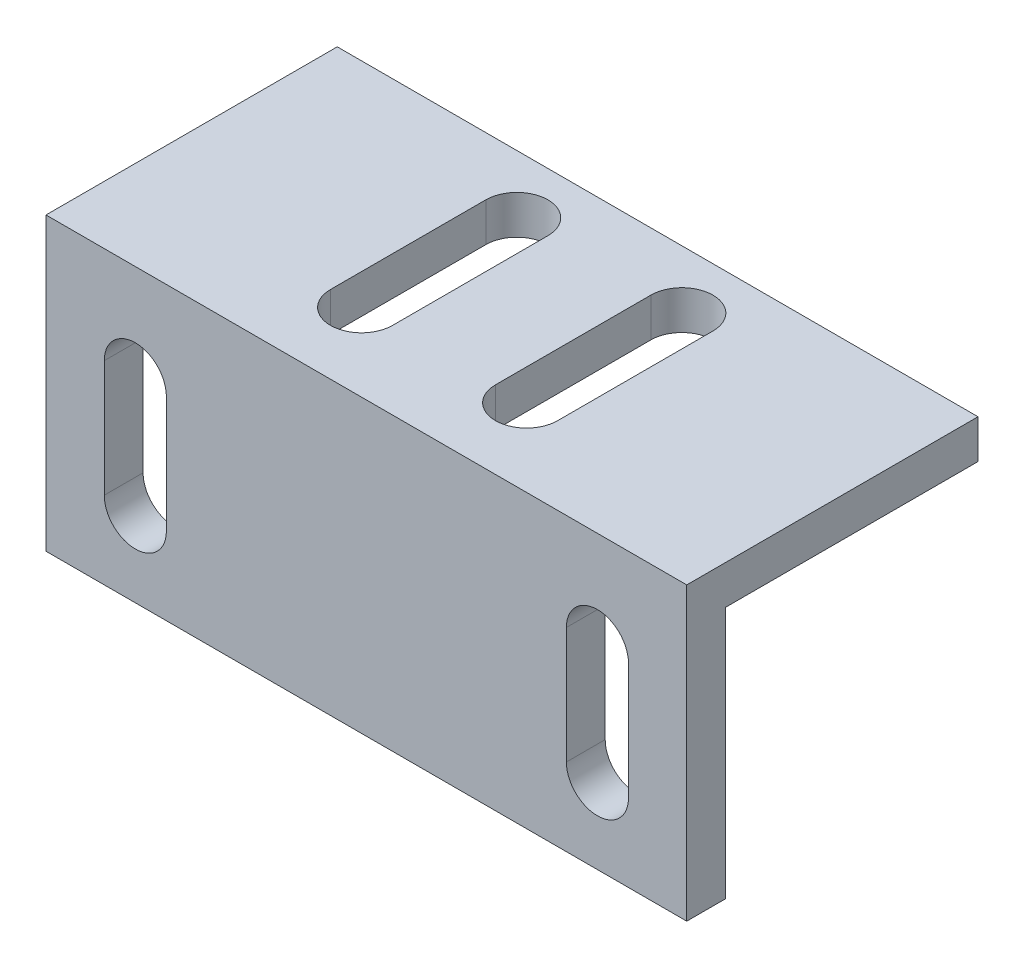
from build123d import *

# Parameters (mm, degrees)
EXTRUDE_1_DEPTH     = 33
CUT_EXTRUDE_1_DEPTH = 40.230090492
CUT_EXTRUDE_2_DEPTH = 40.230090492


with BuildPart() as part:
    # Sketch 1 → Extrude 1 (new body)
    with BuildSketch(Plane(origin=(0, 0, 0), x_dir=(0, 0, -1), z_dir=(1, 0, 0))):
        Polygon((0, 0), (0, 15), (15, 15), (15, 13), (2, 13), (2, 0), align=None)
    extrude(amount=EXTRUDE_1_DEPTH)

    # Sketch 2 → Cut-Extrude 1 (cut, through all)
    with BuildSketch(Plane.XY):
        with BuildLine():
            Line((6.2, 10), (6.2, 4))
            ThreePointArc((6.2, 4), (4.6, 2.4), (3, 4))
            Line((3, 4), (3, 10))
            ThreePointArc((3, 10), (4.6, 11.6), (6.2, 10))
        make_face()
        with BuildLine():
            Line((30, 10), (30, 4))
            ThreePointArc((30, 4), (28.4, 2.4), (26.8, 4))
            Line((26.8, 4), (26.8, 10))
            ThreePointArc((26.8, 10), (28.4, 11.6), (30, 10))
        make_face()
    extrude(amount=-CUT_EXTRUDE_1_DEPTH, mode=Mode.SUBTRACT)

    # Sketch 3 → Cut-Extrude 2 (cut, through all)
    with BuildSketch(Plane(origin=(0, 15, 0), x_dir=(1, 0, 0), z_dir=(0, 1, 0))):
        with BuildLine():
            Line((13.85, 12), (13.85, 4))
            ThreePointArc((13.85, 4), (12.25, 2.4), (10.65, 4))
            Line((10.65, 4), (10.65, 12))
            ThreePointArc((10.65, 12), (12.25, 13.6), (13.85, 12))
        make_face()
        with BuildLine():
            Line((22.35, 12), (22.35, 4))
            ThreePointArc((22.35, 4), (20.75, 2.4), (19.15, 4))
            Line((19.15, 4), (19.15, 12))
            ThreePointArc((19.15, 12), (20.75, 13.6), (22.35, 12))
        make_face()
    extrude(amount=-CUT_EXTRUDE_2_DEPTH, mode=Mode.SUBTRACT)


solid = part.part
